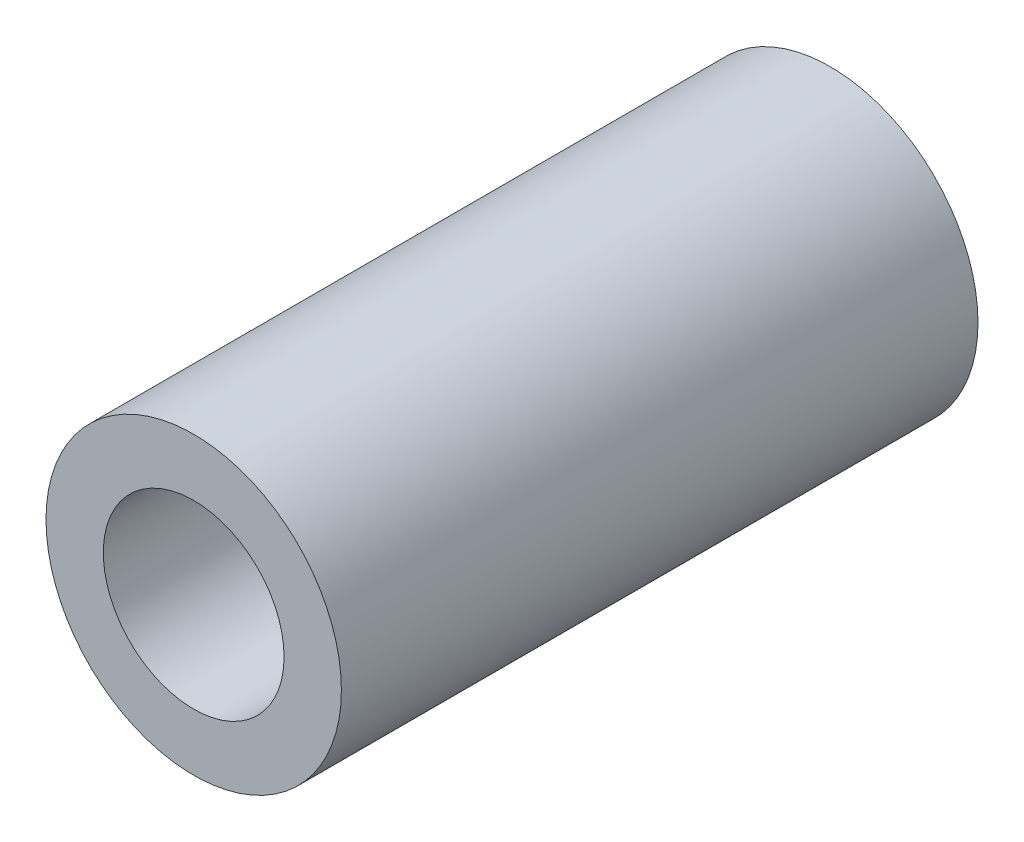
from build123d import *

# Parameters (mm, degrees)
ESQUISSE1_R      = 11.6
ESQUISSE1_R_2    = 4.6
EXTRUSION1_DEPTH = 50
ESQUISSE2_R      = 7.1
EXTRUSION2_DEPTH = 20


with BuildPart() as part:
    # Esquisse1 → Extrusion1 (new body)
    with BuildSketch(Plane.XY):
        Circle(ESQUISSE1_R)
        Circle(ESQUISSE1_R_2, mode=Mode.SUBTRACT)
    extrude(amount=EXTRUSION1_DEPTH)

    # Esquisse2 → Extrusion2 (cut)
    with BuildSketch(Plane.XY.offset(50)):
        Circle(ESQUISSE2_R)
    extrude(amount=-EXTRUSION2_DEPTH, mode=Mode.SUBTRACT)


solid = part.part
